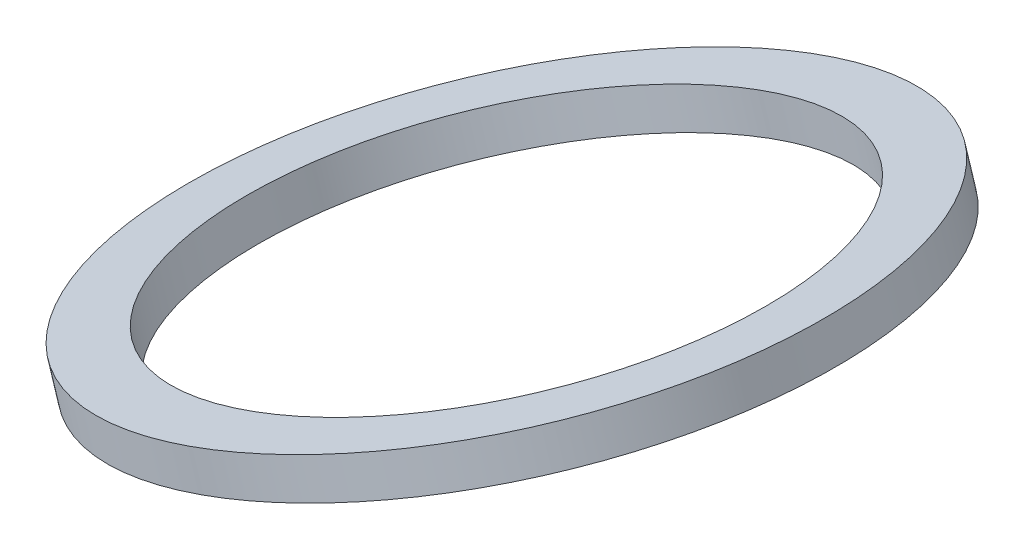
from build123d import *


with BuildPart() as part:
    # Sk_Arandela → Arandela (revolve)
    with BuildSketch(Plane.XY, mode=Mode.PRIVATE) as arandela_sk:
        Polygon((372.818828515, 556.950499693), (375.870714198, 557.912785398), (376.472142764, 556.005356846), (373.42025708, 555.043071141), align=None)
    revolve(arandela_sk.sketch.rotate(Axis((357.677142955, 557.418856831, 0), (0.3007142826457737, -0.9537142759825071, 0)), 180), axis=Axis((357.677142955, 557.418856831, 0), (0.3007142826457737, -0.9537142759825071, 0)))


solid = part.part
